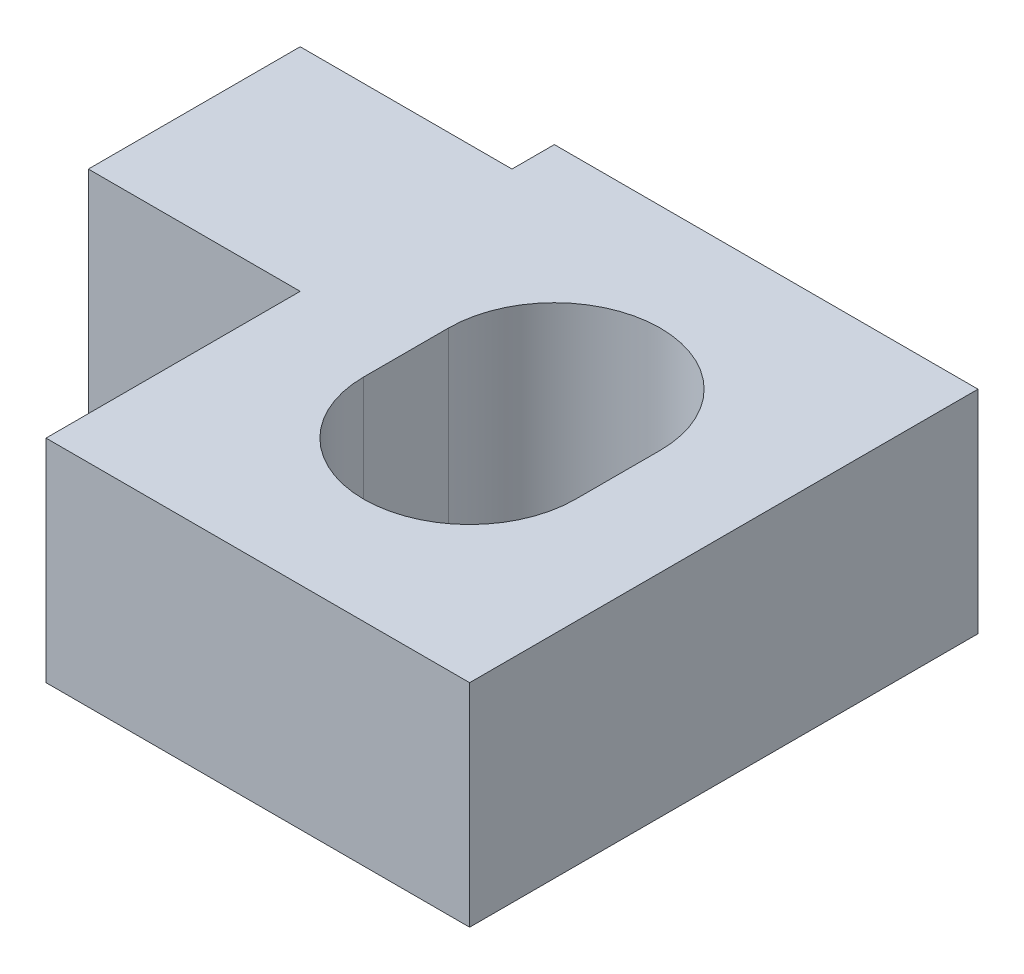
ISO-10303-21;
HEADER;
FILE_DESCRIPTION(('STEP AP214'),'2;1');
FILE_NAME('part.step','',(''),(''),'','','');
FILE_SCHEMA(('AUTOMOTIVE_DESIGN { 1 0 10303 214 1 1 1 1 }'));
ENDSEC;
DATA;
#1=APPLICATION_CONTEXT('core data for automotive mechanical design processes');
#2=APPLICATION_PROTOCOL_DEFINITION('international standard','automotive_design',2000,#1);
#3=PRODUCT_CONTEXT('',#1,'mechanical');
#4=PRODUCT('Part','Part','',(#3));
#5=PRODUCT_RELATED_PRODUCT_CATEGORY('part','',(#4));
#6=PRODUCT_DEFINITION_FORMATION('','',#4);
#7=PRODUCT_DEFINITION_CONTEXT('part definition',#1,'design');
#8=PRODUCT_DEFINITION('design','',#6,#7);
#9=PRODUCT_DEFINITION_SHAPE('','',#8);
#10=(LENGTH_UNIT() NAMED_UNIT(*) SI_UNIT(.MILLI.,.METRE.));
#11=(NAMED_UNIT(*) PLANE_ANGLE_UNIT() SI_UNIT($,.RADIAN.));
#12=(NAMED_UNIT(*) SI_UNIT($,.STERADIAN.) SOLID_ANGLE_UNIT());
#13=UNCERTAINTY_MEASURE_WITH_UNIT(LENGTH_MEASURE(1.E-05),#10,'distance_accuracy_value','');
#14=(GEOMETRIC_REPRESENTATION_CONTEXT(3) GLOBAL_UNCERTAINTY_ASSIGNED_CONTEXT((#13)) GLOBAL_UNIT_ASSIGNED_CONTEXT((#10,
#11,#12)) REPRESENTATION_CONTEXT('',''));
#15=CARTESIAN_POINT('',(0.,0.,0.));
#16=DIRECTION('',(0.,0.,1.));
#17=DIRECTION('',(1.,0.,0.));
#18=AXIS2_PLACEMENT_3D('',#15,#16,#17);
#19=CARTESIAN_POINT('',(0.,5.,0.));
#20=DIRECTION('',(0.,-1.,0.));
#21=DIRECTION('',(0.,0.,-1.));
#22=AXIS2_PLACEMENT_3D('',#19,#20,#21);
#23=PLANE('',#22);
#24=DIRECTION('',(1.,0.,0.));
#25=VECTOR('',#24,1.);
#26=CARTESIAN_POINT('',(-5.,5.,6.));
#27=LINE('',#26,#25);
#28=CARTESIAN_POINT('',(-5.,5.,6.));
#29=VERTEX_POINT('',#28);
#30=CARTESIAN_POINT('',(5.,5.,6.));
#31=VERTEX_POINT('',#30);
#32=EDGE_CURVE('E177',#29,#31,#27,.T.);
#33=ORIENTED_EDGE('',*,*,#32,.T.);
#34=DIRECTION('',(0.,0.,-1.));
#35=VECTOR('',#34,1.);
#36=CARTESIAN_POINT('',(5.,5.,-6.));
#37=LINE('',#36,#35);
#38=CARTESIAN_POINT('',(5.,5.,-6.));
#39=VERTEX_POINT('',#38);
#40=EDGE_CURVE('E181',#31,#39,#37,.T.);
#41=ORIENTED_EDGE('',*,*,#40,.T.);
#42=DIRECTION('',(-1.,0.,0.));
#43=VECTOR('',#42,1.);
#44=CARTESIAN_POINT('',(-5.,5.,-6.));
#45=LINE('',#44,#43);
#46=CARTESIAN_POINT('',(-5.,5.,-6.));
#47=VERTEX_POINT('',#46);
#48=EDGE_CURVE('E185',#39,#47,#45,.T.);
#49=ORIENTED_EDGE('',*,*,#48,.T.);
#50=DIRECTION('',(0.,0.,1.));
#51=VECTOR('',#50,1.);
#52=CARTESIAN_POINT('',(-5.,5.,-5.));
#53=LINE('',#52,#51);
#54=CARTESIAN_POINT('',(-5.,5.,-5.));
#55=VERTEX_POINT('',#54);
#56=EDGE_CURVE('E188',#47,#55,#53,.T.);
#57=ORIENTED_EDGE('',*,*,#56,.T.);
#58=DIRECTION('',(-1.,0.,0.));
#59=VECTOR('',#58,1.);
#60=CARTESIAN_POINT('',(-10.,5.,-5.));
#61=LINE('',#60,#59);
#62=CARTESIAN_POINT('',(-10.,5.,-5.));
#63=VERTEX_POINT('',#62);
#64=EDGE_CURVE('E191',#55,#63,#61,.T.);
#65=ORIENTED_EDGE('',*,*,#64,.T.);
#66=DIRECTION('',(0.,0.,1.));
#67=VECTOR('',#66,1.);
#68=CARTESIAN_POINT('',(-10.,5.,0.));
#69=LINE('',#68,#67);
#70=CARTESIAN_POINT('',(-10.,5.,0.));
#71=VERTEX_POINT('',#70);
#72=EDGE_CURVE('E194',#63,#71,#69,.T.);
#73=ORIENTED_EDGE('',*,*,#72,.T.);
#74=DIRECTION('',(1.,0.,0.));
#75=VECTOR('',#74,1.);
#76=CARTESIAN_POINT('',(-10.,5.,0.));
#77=LINE('',#76,#75);
#78=CARTESIAN_POINT('',(-5.,5.,0.));
#79=VERTEX_POINT('',#78);
#80=EDGE_CURVE('E197',#71,#79,#77,.T.);
#81=ORIENTED_EDGE('',*,*,#80,.T.);
#82=DIRECTION('',(0.,0.,1.));
#83=VECTOR('',#82,1.);
#84=CARTESIAN_POINT('',(-5.,5.,0.));
#85=LINE('',#84,#83);
#86=EDGE_CURVE('E200',#79,#29,#85,.T.);
#87=ORIENTED_EDGE('',*,*,#86,.T.);
#88=EDGE_LOOP('',(#33,#41,#49,#57,#65,#73,#81,#87));
#89=FACE_BOUND('',#88,.T.);
#90=CARTESIAN_POINT('',(0.,5.,1.));
#91=DIRECTION('',(0.,1.,0.));
#92=DIRECTION('',(0.,0.,1.));
#93=AXIS2_PLACEMENT_3D('',#90,#91,#92);
#94=CIRCLE('',#93,2.5);
#95=CARTESIAN_POINT('',(-2.5,5.,1.));
#96=VERTEX_POINT('',#95);
#97=CARTESIAN_POINT('',(2.5,5.,1.));
#98=VERTEX_POINT('',#97);
#99=EDGE_CURVE('E129',#96,#98,#94,.T.);
#100=ORIENTED_EDGE('',*,*,#99,.F.);
#101=DIRECTION('',(0.,0.,1.));
#102=VECTOR('',#101,1.);
#103=CARTESIAN_POINT('',(-2.5,5.,1.));
#104=LINE('',#103,#102);
#105=CARTESIAN_POINT('',(-2.5,5.,-1.));
#106=VERTEX_POINT('',#105);
#107=EDGE_CURVE('E155',#106,#96,#104,.T.);
#108=ORIENTED_EDGE('',*,*,#107,.F.);
#109=CARTESIAN_POINT('',(0.,5.,-1.));
#110=DIRECTION('',(0.,1.,0.));
#111=DIRECTION('',(0.,0.,1.));
#112=AXIS2_PLACEMENT_3D('',#109,#110,#111);
#113=CIRCLE('',#112,2.5);
#114=CARTESIAN_POINT('',(2.5,5.,-1.));
#115=VERTEX_POINT('',#114);
#116=EDGE_CURVE('E151',#115,#106,#113,.T.);
#117=ORIENTED_EDGE('',*,*,#116,.F.);
#118=DIRECTION('',(0.,0.,-1.));
#119=VECTOR('',#118,1.);
#120=CARTESIAN_POINT('',(2.5,5.,1.));
#121=LINE('',#120,#119);
#122=EDGE_CURVE('E138',#98,#115,#121,.T.);
#123=ORIENTED_EDGE('',*,*,#122,.F.);
#124=EDGE_LOOP('',(#100,#108,#117,#123));
#125=FACE_BOUND('',#124,.T.);
#126=ADVANCED_FACE('F39',(#89,#125),#23,.F.);
#127=CARTESIAN_POINT('',(0.,0.,0.));
#128=DIRECTION('',(0.,-1.,0.));
#129=DIRECTION('',(0.,0.,-1.));
#130=AXIS2_PLACEMENT_3D('',#127,#128,#129);
#131=PLANE('',#130);
#132=DIRECTION('',(1.,0.,0.));
#133=VECTOR('',#132,1.);
#134=CARTESIAN_POINT('',(-5.,0.,6.));
#135=LINE('',#134,#133);
#136=CARTESIAN_POINT('',(-5.,0.,6.));
#137=VERTEX_POINT('',#136);
#138=CARTESIAN_POINT('',(5.,0.,6.));
#139=VERTEX_POINT('',#138);
#140=EDGE_CURVE('E147',#137,#139,#135,.T.);
#141=ORIENTED_EDGE('',*,*,#140,.F.);
#142=DIRECTION('',(0.,0.,1.));
#143=VECTOR('',#142,1.);
#144=CARTESIAN_POINT('',(-5.,0.,0.));
#145=LINE('',#144,#143);
#146=CARTESIAN_POINT('',(-5.,0.,0.));
#147=VERTEX_POINT('',#146);
#148=EDGE_CURVE('E182',#147,#137,#145,.T.);
#149=ORIENTED_EDGE('',*,*,#148,.F.);
#150=DIRECTION('',(1.,0.,0.));
#151=VECTOR('',#150,1.);
#152=CARTESIAN_POINT('',(-10.,0.,0.));
#153=LINE('',#152,#151);
#154=CARTESIAN_POINT('',(-10.,0.,0.));
#155=VERTEX_POINT('',#154);
#156=EDGE_CURVE('E222',#155,#147,#153,.T.);
#157=ORIENTED_EDGE('',*,*,#156,.F.);
#158=DIRECTION('',(0.,0.,1.));
#159=VECTOR('',#158,1.);
#160=CARTESIAN_POINT('',(-10.,0.,0.));
#161=LINE('',#160,#159);
#162=CARTESIAN_POINT('',(-10.,0.,-5.));
#163=VERTEX_POINT('',#162);
#164=EDGE_CURVE('E219',#163,#155,#161,.T.);
#165=ORIENTED_EDGE('',*,*,#164,.F.);
#166=DIRECTION('',(-1.,0.,0.));
#167=VECTOR('',#166,1.);
#168=CARTESIAN_POINT('',(-10.,0.,-5.));
#169=LINE('',#168,#167);
#170=CARTESIAN_POINT('',(-5.,0.,-5.));
#171=VERTEX_POINT('',#170);
#172=EDGE_CURVE('E216',#171,#163,#169,.T.);
#173=ORIENTED_EDGE('',*,*,#172,.F.);
#174=DIRECTION('',(0.,0.,1.));
#175=VECTOR('',#174,1.);
#176=CARTESIAN_POINT('',(-5.,0.,-5.));
#177=LINE('',#176,#175);
#178=CARTESIAN_POINT('',(-5.,0.,-6.));
#179=VERTEX_POINT('',#178);
#180=EDGE_CURVE('E213',#179,#171,#177,.T.);
#181=ORIENTED_EDGE('',*,*,#180,.F.);
#182=DIRECTION('',(-1.,0.,0.));
#183=VECTOR('',#182,1.);
#184=CARTESIAN_POINT('',(-5.,0.,-6.));
#185=LINE('',#184,#183);
#186=CARTESIAN_POINT('',(5.,0.,-6.));
#187=VERTEX_POINT('',#186);
#188=EDGE_CURVE('E210',#187,#179,#185,.T.);
#189=ORIENTED_EDGE('',*,*,#188,.F.);
#190=DIRECTION('',(0.,0.,-1.));
#191=VECTOR('',#190,1.);
#192=CARTESIAN_POINT('',(5.,0.,-6.));
#193=LINE('',#192,#191);
#194=EDGE_CURVE('E207',#139,#187,#193,.T.);
#195=ORIENTED_EDGE('',*,*,#194,.F.);
#196=EDGE_LOOP('',(#141,#149,#157,#165,#173,#181,#189,#195));
#197=FACE_BOUND('',#196,.T.);
#198=DIRECTION('',(0.,0.,1.));
#199=VECTOR('',#198,1.);
#200=CARTESIAN_POINT('',(-2.5,0.,1.));
#201=LINE('',#200,#199);
#202=CARTESIAN_POINT('',(-2.5,0.,-1.));
#203=VERTEX_POINT('',#202);
#204=CARTESIAN_POINT('',(-2.5,0.,1.));
#205=VERTEX_POINT('',#204);
#206=EDGE_CURVE('E139',#203,#205,#201,.T.);
#207=ORIENTED_EDGE('',*,*,#206,.T.);
#208=CARTESIAN_POINT('',(0.,0.,1.));
#209=DIRECTION('',(0.,1.,0.));
#210=DIRECTION('',(0.,0.,1.));
#211=AXIS2_PLACEMENT_3D('',#208,#209,#210);
#212=CIRCLE('',#211,2.5);
#213=CARTESIAN_POINT('',(2.5,0.,1.));
#214=VERTEX_POINT('',#213);
#215=EDGE_CURVE('E63',#205,#214,#212,.T.);
#216=ORIENTED_EDGE('',*,*,#215,.T.);
#217=DIRECTION('',(0.,0.,-1.));
#218=VECTOR('',#217,1.);
#219=CARTESIAN_POINT('',(2.5,0.,1.));
#220=LINE('',#219,#218);
#221=CARTESIAN_POINT('',(2.5,0.,-1.));
#222=VERTEX_POINT('',#221);
#223=EDGE_CURVE('E145',#214,#222,#220,.T.);
#224=ORIENTED_EDGE('',*,*,#223,.T.);
#225=CARTESIAN_POINT('',(0.,0.,-1.));
#226=DIRECTION('',(0.,1.,0.));
#227=DIRECTION('',(0.,0.,1.));
#228=AXIS2_PLACEMENT_3D('',#225,#226,#227);
#229=CIRCLE('',#228,2.5);
#230=EDGE_CURVE('E164',#222,#203,#229,.T.);
#231=ORIENTED_EDGE('',*,*,#230,.T.);
#232=EDGE_LOOP('',(#207,#216,#224,#231));
#233=FACE_BOUND('',#232,.T.);
#234=ADVANCED_FACE('F261',(#197,#233),#131,.T.);
#235=CARTESIAN_POINT('',(-5.,5.,6.));
#236=DIRECTION('',(0.,0.,-1.));
#237=DIRECTION('',(-1.,0.,0.));
#238=AXIS2_PLACEMENT_3D('',#235,#236,#237);
#239=PLANE('',#238);
#240=ORIENTED_EDGE('',*,*,#140,.T.);
#241=DIRECTION('',(0.,-1.,0.));
#242=VECTOR('',#241,1.);
#243=CARTESIAN_POINT('',(5.,5.,6.));
#244=LINE('',#243,#242);
#245=EDGE_CURVE('E11',#31,#139,#244,.T.);
#246=ORIENTED_EDGE('',*,*,#245,.F.);
#247=ORIENTED_EDGE('',*,*,#32,.F.);
#248=DIRECTION('',(0.,-1.,0.));
#249=VECTOR('',#248,1.);
#250=CARTESIAN_POINT('',(-5.,5.,6.));
#251=LINE('',#250,#249);
#252=EDGE_CURVE('E203',#29,#137,#251,.T.);
#253=ORIENTED_EDGE('',*,*,#252,.T.);
#254=EDGE_LOOP('',(#240,#246,#247,#253));
#255=FACE_BOUND('',#254,.T.);
#256=ADVANCED_FACE('F41',(#255),#239,.F.);
#257=CARTESIAN_POINT('',(5.,5.,-6.));
#258=DIRECTION('',(-1.,0.,0.));
#259=DIRECTION('',(0.,0.,1.));
#260=AXIS2_PLACEMENT_3D('',#257,#258,#259);
#261=PLANE('',#260);
#262=ORIENTED_EDGE('',*,*,#194,.T.);
#263=DIRECTION('',(0.,-1.,0.));
#264=VECTOR('',#263,1.);
#265=CARTESIAN_POINT('',(5.,5.,-6.));
#266=LINE('',#265,#264);
#267=EDGE_CURVE('E48',#39,#187,#266,.T.);
#268=ORIENTED_EDGE('',*,*,#267,.F.);
#269=ORIENTED_EDGE('',*,*,#40,.F.);
#270=ORIENTED_EDGE('',*,*,#245,.T.);
#271=EDGE_LOOP('',(#262,#268,#269,#270));
#272=FACE_BOUND('',#271,.T.);
#273=ADVANCED_FACE('F278',(#272),#261,.F.);
#274=CARTESIAN_POINT('',(-5.,5.,-6.));
#275=DIRECTION('',(0.,0.,1.));
#276=DIRECTION('',(1.,0.,0.));
#277=AXIS2_PLACEMENT_3D('',#274,#275,#276);
#278=PLANE('',#277);
#279=ORIENTED_EDGE('',*,*,#188,.T.);
#280=DIRECTION('',(0.,-1.,0.));
#281=VECTOR('',#280,1.);
#282=CARTESIAN_POINT('',(-5.,5.,-6.));
#283=LINE('',#282,#281);
#284=EDGE_CURVE('E246',#47,#179,#283,.T.);
#285=ORIENTED_EDGE('',*,*,#284,.F.);
#286=ORIENTED_EDGE('',*,*,#48,.F.);
#287=ORIENTED_EDGE('',*,*,#267,.T.);
#288=EDGE_LOOP('',(#279,#285,#286,#287));
#289=FACE_BOUND('',#288,.T.);
#290=ADVANCED_FACE('F255',(#289),#278,.F.);
#291=CARTESIAN_POINT('',(-5.,5.,-5.));
#292=DIRECTION('',(1.,0.,0.));
#293=DIRECTION('',(0.,0.,-1.));
#294=AXIS2_PLACEMENT_3D('',#291,#292,#293);
#295=PLANE('',#294);
#296=ORIENTED_EDGE('',*,*,#180,.T.);
#297=DIRECTION('',(0.,-1.,0.));
#298=VECTOR('',#297,1.);
#299=CARTESIAN_POINT('',(-5.,5.,-5.));
#300=LINE('',#299,#298);
#301=EDGE_CURVE('E242',#55,#171,#300,.T.);
#302=ORIENTED_EDGE('',*,*,#301,.F.);
#303=ORIENTED_EDGE('',*,*,#56,.F.);
#304=ORIENTED_EDGE('',*,*,#284,.T.);
#305=EDGE_LOOP('',(#296,#302,#303,#304));
#306=FACE_BOUND('',#305,.T.);
#307=ADVANCED_FACE('F267',(#306),#295,.F.);
#308=CARTESIAN_POINT('',(-10.,5.,-5.));
#309=DIRECTION('',(0.,0.,1.));
#310=DIRECTION('',(1.,0.,0.));
#311=AXIS2_PLACEMENT_3D('',#308,#309,#310);
#312=PLANE('',#311);
#313=ORIENTED_EDGE('',*,*,#172,.T.);
#314=DIRECTION('',(0.,-1.,0.));
#315=VECTOR('',#314,1.);
#316=CARTESIAN_POINT('',(-10.,5.,-5.));
#317=LINE('',#316,#315);
#318=EDGE_CURVE('E238',#63,#163,#317,.T.);
#319=ORIENTED_EDGE('',*,*,#318,.F.);
#320=ORIENTED_EDGE('',*,*,#64,.F.);
#321=ORIENTED_EDGE('',*,*,#301,.T.);
#322=EDGE_LOOP('',(#313,#319,#320,#321));
#323=FACE_BOUND('',#322,.T.);
#324=ADVANCED_FACE('F271',(#323),#312,.F.);
#325=CARTESIAN_POINT('',(-10.,5.,0.));
#326=DIRECTION('',(1.,0.,0.));
#327=DIRECTION('',(0.,0.,-1.));
#328=AXIS2_PLACEMENT_3D('',#325,#326,#327);
#329=PLANE('',#328);
#330=ORIENTED_EDGE('',*,*,#164,.T.);
#331=DIRECTION('',(0.,-1.,0.));
#332=VECTOR('',#331,1.);
#333=CARTESIAN_POINT('',(-10.,5.,0.));
#334=LINE('',#333,#332);
#335=EDGE_CURVE('E234',#71,#155,#334,.T.);
#336=ORIENTED_EDGE('',*,*,#335,.F.);
#337=ORIENTED_EDGE('',*,*,#72,.F.);
#338=ORIENTED_EDGE('',*,*,#318,.T.);
#339=EDGE_LOOP('',(#330,#336,#337,#338));
#340=FACE_BOUND('',#339,.T.);
#341=ADVANCED_FACE('F291',(#340),#329,.F.);
#342=CARTESIAN_POINT('',(-10.,5.,0.));
#343=DIRECTION('',(0.,0.,-1.));
#344=DIRECTION('',(-1.,0.,0.));
#345=AXIS2_PLACEMENT_3D('',#342,#343,#344);
#346=PLANE('',#345);
#347=ORIENTED_EDGE('',*,*,#156,.T.);
#348=DIRECTION('',(0.,-1.,0.));
#349=VECTOR('',#348,1.);
#350=CARTESIAN_POINT('',(-5.,5.,0.));
#351=LINE('',#350,#349);
#352=EDGE_CURVE('E230',#79,#147,#351,.T.);
#353=ORIENTED_EDGE('',*,*,#352,.F.);
#354=ORIENTED_EDGE('',*,*,#80,.F.);
#355=ORIENTED_EDGE('',*,*,#335,.T.);
#356=EDGE_LOOP('',(#347,#353,#354,#355));
#357=FACE_BOUND('',#356,.T.);
#358=ADVANCED_FACE('F289',(#357),#346,.F.);
#359=CARTESIAN_POINT('',(-5.,5.,0.));
#360=DIRECTION('',(1.,0.,0.));
#361=DIRECTION('',(0.,0.,-1.));
#362=AXIS2_PLACEMENT_3D('',#359,#360,#361);
#363=PLANE('',#362);
#364=ORIENTED_EDGE('',*,*,#148,.T.);
#365=ORIENTED_EDGE('',*,*,#252,.F.);
#366=ORIENTED_EDGE('',*,*,#86,.F.);
#367=ORIENTED_EDGE('',*,*,#352,.T.);
#368=EDGE_LOOP('',(#364,#365,#366,#367));
#369=FACE_BOUND('',#368,.T.);
#370=ADVANCED_FACE('F284',(#369),#363,.F.);
#371=CARTESIAN_POINT('',(0.,5.,1.));
#372=DIRECTION('',(0.,-1.,0.));
#373=DIRECTION('',(0.,0.,-1.));
#374=AXIS2_PLACEMENT_3D('',#371,#372,#373);
#375=CYLINDRICAL_SURFACE('',#374,2.5);
#376=ORIENTED_EDGE('',*,*,#215,.F.);
#377=DIRECTION('',(0.,-1.,0.));
#378=VECTOR('',#377,1.);
#379=CARTESIAN_POINT('',(-2.5,5.,1.));
#380=LINE('',#379,#378);
#381=EDGE_CURVE('E133',#96,#205,#380,.T.);
#382=ORIENTED_EDGE('',*,*,#381,.F.);
#383=ORIENTED_EDGE('',*,*,#99,.T.);
#384=DIRECTION('',(0.,-1.,0.));
#385=VECTOR('',#384,1.);
#386=CARTESIAN_POINT('',(2.5,5.,1.));
#387=LINE('',#386,#385);
#388=EDGE_CURVE('E132',#98,#214,#387,.T.);
#389=ORIENTED_EDGE('',*,*,#388,.T.);
#390=EDGE_LOOP('',(#376,#382,#383,#389));
#391=FACE_BOUND('',#390,.T.);
#392=ADVANCED_FACE('F131',(#391),#375,.F.);
#393=CARTESIAN_POINT('',(2.5,5.,1.));
#394=DIRECTION('',(-1.,0.,0.));
#395=DIRECTION('',(0.,0.,1.));
#396=AXIS2_PLACEMENT_3D('',#393,#394,#395);
#397=PLANE('',#396);
#398=ORIENTED_EDGE('',*,*,#223,.F.);
#399=ORIENTED_EDGE('',*,*,#388,.F.);
#400=ORIENTED_EDGE('',*,*,#122,.T.);
#401=DIRECTION('',(0.,-1.,0.));
#402=VECTOR('',#401,1.);
#403=CARTESIAN_POINT('',(2.5,5.,-1.));
#404=LINE('',#403,#402);
#405=EDGE_CURVE('E148',#115,#222,#404,.T.);
#406=ORIENTED_EDGE('',*,*,#405,.T.);
#407=EDGE_LOOP('',(#398,#399,#400,#406));
#408=FACE_BOUND('',#407,.T.);
#409=ADVANCED_FACE('F142',(#408),#397,.T.);
#410=CARTESIAN_POINT('',(0.,5.,-1.));
#411=DIRECTION('',(0.,-1.,0.));
#412=DIRECTION('',(0.,0.,-1.));
#413=AXIS2_PLACEMENT_3D('',#410,#411,#412);
#414=CYLINDRICAL_SURFACE('',#413,2.5);
#415=ORIENTED_EDGE('',*,*,#230,.F.);
#416=ORIENTED_EDGE('',*,*,#405,.F.);
#417=ORIENTED_EDGE('',*,*,#116,.T.);
#418=DIRECTION('',(0.,-1.,0.));
#419=VECTOR('',#418,1.);
#420=CARTESIAN_POINT('',(-2.5,5.,-1.));
#421=LINE('',#420,#419);
#422=EDGE_CURVE('E55',#106,#203,#421,.T.);
#423=ORIENTED_EDGE('',*,*,#422,.T.);
#424=EDGE_LOOP('',(#415,#416,#417,#423));
#425=FACE_BOUND('',#424,.T.);
#426=ADVANCED_FACE('F316',(#425),#414,.F.);
#427=CARTESIAN_POINT('',(-2.5,5.,1.));
#428=DIRECTION('',(1.,0.,0.));
#429=DIRECTION('',(0.,0.,-1.));
#430=AXIS2_PLACEMENT_3D('',#427,#428,#429);
#431=PLANE('',#430);
#432=ORIENTED_EDGE('',*,*,#206,.F.);
#433=ORIENTED_EDGE('',*,*,#422,.F.);
#434=ORIENTED_EDGE('',*,*,#107,.T.);
#435=ORIENTED_EDGE('',*,*,#381,.T.);
#436=EDGE_LOOP('',(#432,#433,#434,#435));
#437=FACE_BOUND('',#436,.T.);
#438=ADVANCED_FACE('F320',(#437),#431,.T.);
#439=CLOSED_SHELL('',(#126,#234,#256,#273,#290,#307,#324,#341,#358,#370,#392,#409,#426,#438));
#440=MANIFOLD_SOLID_BREP('B2',#439);
#441=ADVANCED_BREP_SHAPE_REPRESENTATION('',(#18,#440),#14);
#442=SHAPE_DEFINITION_REPRESENTATION(#9,#441);
ENDSEC;
END-ISO-10303-21;
